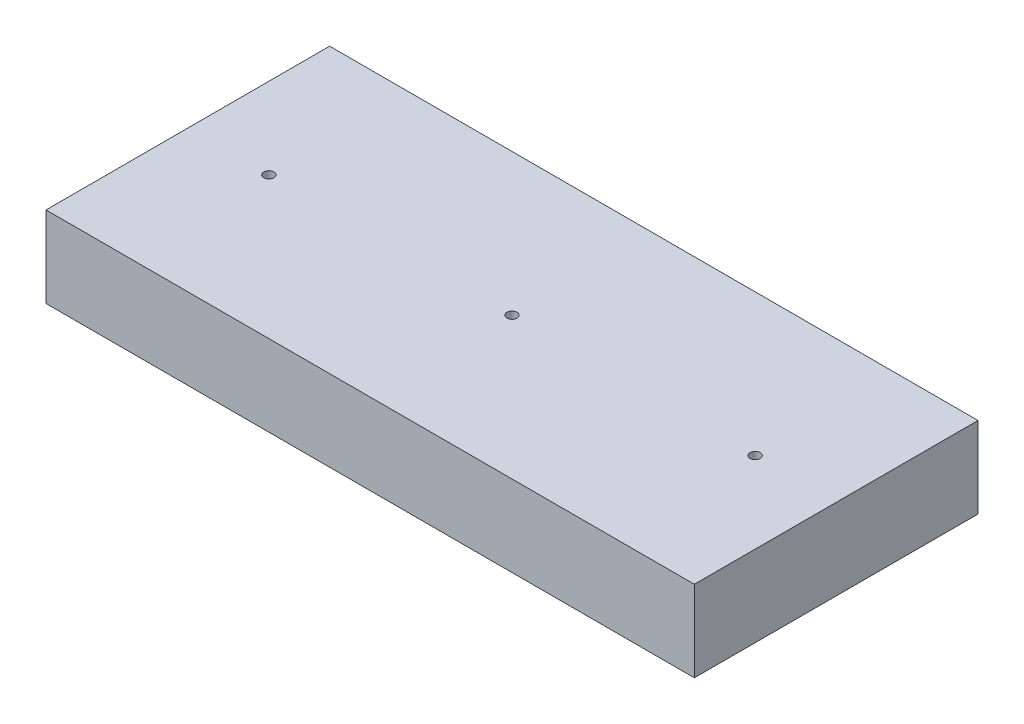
from build123d import *

# Parameters (mm, degrees)
SKETCH1_W           = 203.2
SKETCH1_H           = 88.9
BOSS_EXTRUDE1_DEPTH = 25.4
SKETCH2_R           = 1.5875
CUT_EXTRUDE1_DEPTH  = 114.769602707


with BuildPart() as part:
    # Sketch1 → Boss-Extrude1 (new body)
    with BuildSketch(Plane(origin=(0, 0, 0), x_dir=(1, 0, 0), z_dir=(0, 1, 0))):
        Rectangle(SKETCH1_W, SKETCH1_H)
    extrude(amount=BOSS_EXTRUDE1_DEPTH)

    # Sketch2 → Cut-Extrude1 (cut, through all)
    with BuildSketch(Plane.XZ):
        with Locations(Location((76.2, 0, 0), (0, 0, 270))):
            Circle(SKETCH2_R)
        with Locations(Location((-76.2, 0, 0), (0, 0, 270))):
            Circle(SKETCH2_R)
        with Locations(Location((0, 0, 0), (0, 0, 270))):
            Circle(SKETCH2_R)
    extrude(amount=-CUT_EXTRUDE1_DEPTH, mode=Mode.SUBTRACT)


solid = part.part
